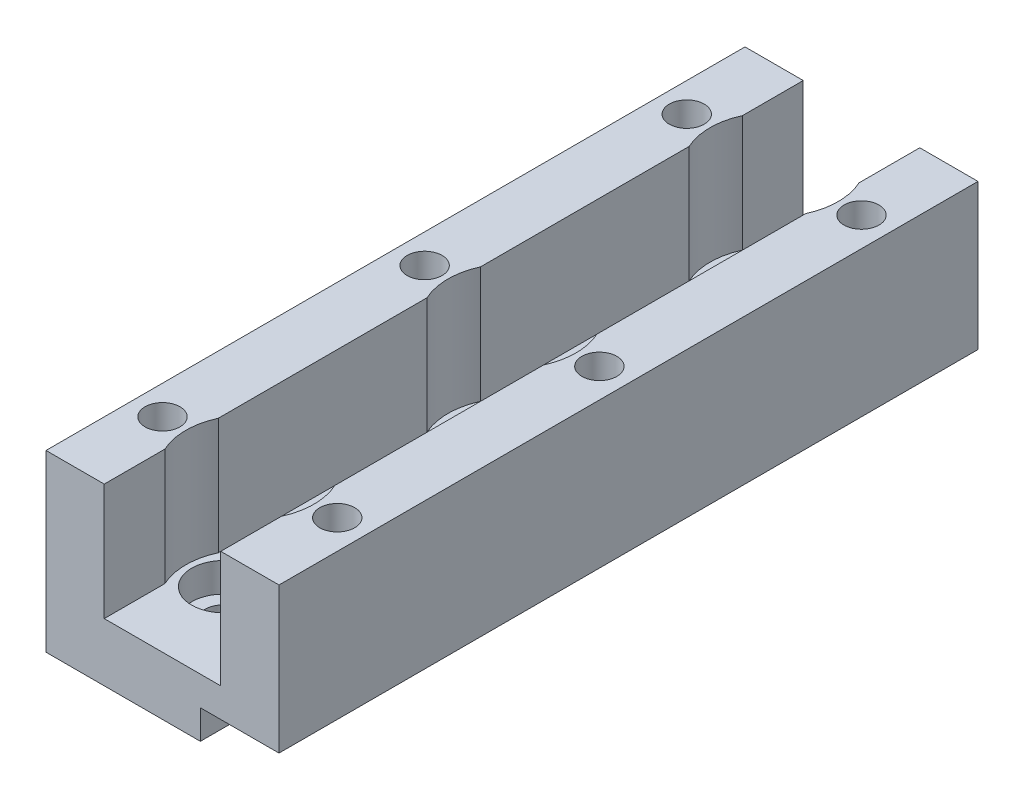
from build123d import *

# Parameters (mm, degrees)
EXTRUSION1_DEPTH                = 120
ENL_V_MAT_EXTRU_1_REACH         = 128.5
ESQUISSE2_R                     = 3
R_P_TITION_LIN_AIRE1_COUNT      = 3
R_P_TITION_LIN_AIRE1_PITCH      = 45
R_P_TITION_LIN_AIRE1_COUNT_DIR2 = 2
R_P_TITION_LIN_AIRE1_PITCH_DIR2 = 30
ENL_V_MAT_EXTRU_2_REACH         = 126.508
ESQUISSE3_R                     = 3.25
ESQUISSE4_R                     = 5.5
ENL_V_MAT_EXTRU_3_DEPTH         = 5
ESQUISSE5_R                     = 11
ENL_V_MAT_EXTRU_4_DEPTH         = 20
R_P_TITION_LIN_AIRE2_COUNT      = 3
R_P_TITION_LIN_AIRE2_PITCH      = 45


with BuildPart() as part:
    # Esquisse1 → Extrusion1 (new body)
    with BuildSketch(Plane.XY):
        Polygon((0, 0), (-26.5, 0), (-26.5, 30), (-16.5, 30), (-16.5, 10), (3.5, 10), (3.5, 30), (13.5, 30), (13.5, 5), (0, 5), align=None)
    extrude(amount=EXTRUSION1_DEPTH)

    # Esquisse2 → Enl_v. mat.-Extru.1 (cut, up to next)
    with BuildSketch(Plane(origin=(0, 30, 0), x_dir=(-1, 0, 0), z_dir=(0, 1, 0)), mode=Mode.PRIVATE) as enl_v_mat_extru_1_sk1:
        with Locations((-8.5, 15)):
            Circle(ESQUISSE2_R)
    enl_v_mat_extru_1_tool1 = extrude(enl_v_mat_extru_1_sk1.sketch, amount=-ENL_V_MAT_EXTRU_1_REACH, mode=Mode.PRIVATE) & part.part
    enl_v_mat_extru_1 = enl_v_mat_extru_1_tool1.solids().sort_by_distance((8.5, 30, 15))[0]
    add(enl_v_mat_extru_1, mode=Mode.SUBTRACT)

    # R_p_tition lin_aire1: Enl_v. mat.-Extru.1; each copy of Enl_v. mat.-Extru.1 runs up to whatever stops it at its own place
    r_p_tition_lin_aire1_before = part.part  # the part as the pattern finds it: every copy runs up to it
    r_p_tition_lin_aire1_enl_v_mat_extru_1_long = extrude(enl_v_mat_extru_1_sk1.sketch, amount=-ENL_V_MAT_EXTRU_1_REACH, mode=Mode.PRIVATE)
    r_p_tition_lin_aire1_enl_v_mat_extru_1_tool1 = r_p_tition_lin_aire1_enl_v_mat_extru_1_long.moved(Location(Vector(0, 0, 1) * (0 * R_P_TITION_LIN_AIRE1_PITCH) + Vector(-1, 0, 0) * (1 * R_P_TITION_LIN_AIRE1_PITCH_DIR2))) & r_p_tition_lin_aire1_before
    add(r_p_tition_lin_aire1_enl_v_mat_extru_1_tool1.solids().sort_by_distance((-21.5, 30, 15))[0], mode=Mode.SUBTRACT)
    r_p_tition_lin_aire1_enl_v_mat_extru_1_tool2 = r_p_tition_lin_aire1_enl_v_mat_extru_1_long.moved(Location(Vector(0, 0, 1) * (1 * R_P_TITION_LIN_AIRE1_PITCH) + Vector(-1, 0, 0) * (0 * R_P_TITION_LIN_AIRE1_PITCH_DIR2))) & r_p_tition_lin_aire1_before
    add(r_p_tition_lin_aire1_enl_v_mat_extru_1_tool2.solids().sort_by_distance((8.5, 30, 60))[0], mode=Mode.SUBTRACT)
    r_p_tition_lin_aire1_enl_v_mat_extru_1_tool3 = r_p_tition_lin_aire1_enl_v_mat_extru_1_long.moved(Location(Vector(0, 0, 1) * (1 * R_P_TITION_LIN_AIRE1_PITCH) + Vector(-1, 0, 0) * (1 * R_P_TITION_LIN_AIRE1_PITCH_DIR2))) & r_p_tition_lin_aire1_before
    add(r_p_tition_lin_aire1_enl_v_mat_extru_1_tool3.solids().sort_by_distance((-21.5, 30, 60))[0], mode=Mode.SUBTRACT)
    r_p_tition_lin_aire1_enl_v_mat_extru_1_tool4 = r_p_tition_lin_aire1_enl_v_mat_extru_1_long.moved(Location(Vector(0, 0, 1) * (2 * R_P_TITION_LIN_AIRE1_PITCH) + Vector(-1, 0, 0) * (0 * R_P_TITION_LIN_AIRE1_PITCH_DIR2))) & r_p_tition_lin_aire1_before
    add(r_p_tition_lin_aire1_enl_v_mat_extru_1_tool4.solids().sort_by_distance((8.5, 30, 105))[0], mode=Mode.SUBTRACT)
    r_p_tition_lin_aire1_enl_v_mat_extru_1_tool5 = r_p_tition_lin_aire1_enl_v_mat_extru_1_long.moved(Location(Vector(0, 0, 1) * (2 * R_P_TITION_LIN_AIRE1_PITCH) + Vector(-1, 0, 0) * (1 * R_P_TITION_LIN_AIRE1_PITCH_DIR2))) & r_p_tition_lin_aire1_before
    add(r_p_tition_lin_aire1_enl_v_mat_extru_1_tool5.solids().sort_by_distance((-21.5, 30, 105))[0], mode=Mode.SUBTRACT)

    # Esquisse3 → Enl_v. mat.-Extru.2 (cut, up to next)
    with BuildSketch(Plane(origin=(0, 10, 0), x_dir=(-1, 0, 0), z_dir=(0, 1, 0)), mode=Mode.PRIVATE) as enl_v_mat_extru_2_sk1:
        with Locations(Location((11, 105, 0), (0, 0, 90))):
            Circle(ESQUISSE3_R)
    enl_v_mat_extru_2_tool1 = extrude(enl_v_mat_extru_2_sk1.sketch, amount=-ENL_V_MAT_EXTRU_2_REACH, mode=Mode.PRIVATE) & part.part
    enl_v_mat_extru_2 = enl_v_mat_extru_2_tool1.solids().sort_by_distance((-11, 10, 105))[0]
    add(enl_v_mat_extru_2, mode=Mode.SUBTRACT)

    # Esquisse4 → Enl_v. mat.-Extru.3 (cut)
    with BuildSketch(Plane(origin=(0, 10, 0), x_dir=(-1, 0, 0), z_dir=(0, 1, 0))):
        with Locations(Location((11, 105, 0), (0, 0, 90))):
            Circle(ESQUISSE4_R)
    enl_v_mat_extru_3 = extrude(amount=-ENL_V_MAT_EXTRU_3_DEPTH, mode=Mode.SUBTRACT)

    # Esquisse5 → Enl_v. mat.-Extru.4 (cut)
    with BuildSketch(Plane(origin=(0, 30, 0), x_dir=(-1, 0, 0), z_dir=(0, 1, 0))):
        with Locations((6.5, 105)):
            Circle(ESQUISSE5_R)
    enl_v_mat_extru_4 = extrude(amount=-ENL_V_MAT_EXTRU_4_DEPTH, mode=Mode.SUBTRACT)

    # R_p_tition lin_aire2: Enl_v. mat.-Extru.2, Enl_v. mat.-Extru.3, Enl_v. mat.-Extru.4 ×3
    with Locations(*[(0, 0, -i * R_P_TITION_LIN_AIRE2_PITCH) for i in range(1, R_P_TITION_LIN_AIRE2_COUNT)]):
        add(enl_v_mat_extru_2, mode=Mode.SUBTRACT)
        add(enl_v_mat_extru_3, mode=Mode.SUBTRACT)
        add(enl_v_mat_extru_4, mode=Mode.SUBTRACT)


solid = part.part
